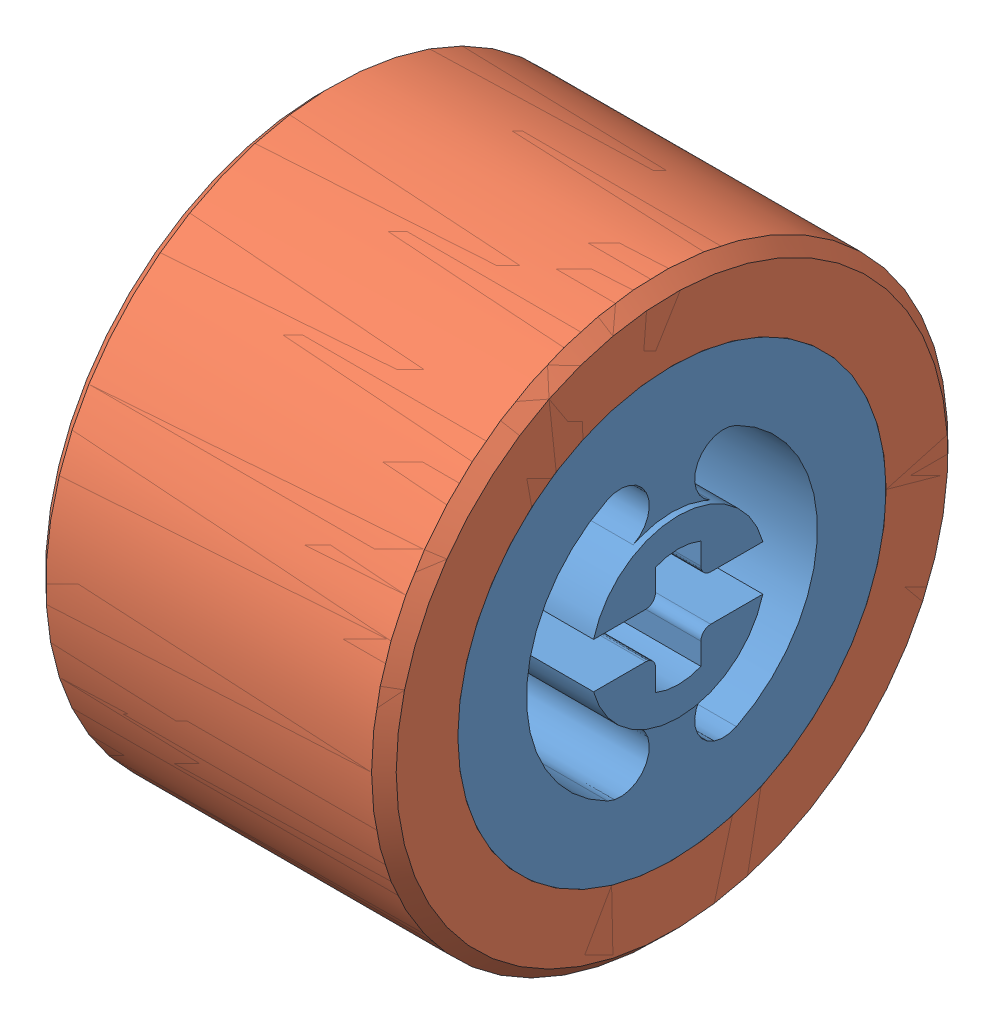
SolidWorks assembly Assem1brede wielen.SLDASM, configuration Default (file format 4400). Lengths in mm.
Overall size (14.73 23.39 23.39).
3 component instances, 2 part files, 4 mates.
Components (placement in the parent):
- wheelDubbel reed-1: wheelDubbel reed.sldprt [Default] at (-3.6359 2.3422 0.3273) size (14.73 17.39 17.39)
- tireSlik-3: tireSlik.sldprt [Default] at (65.1518 2.3422 0.3273) size (14.22 23.39 23.39)
- tireSlik-4: tireSlik.sldprt [Default] at (65.1518 2.3422 0.3273) size (14.22 23.39 23.39)
Mates (geometry in assembly coordinates):
- Concentric2: concentric anti-aligned: cylinder of wheelDubbel reed-1 through (-3.6359 2.3422 0.3273) axis (-1 0 0) radius 8.1153; cylinder of tireSlik-3 through (65.1518 2.3422 0.3273) axis (1 0 0) radius 8.1153
- Coincident2: coincident anti-aligned: plane of wheelDubbel reed-1 through (1.4441 10.4575 0.3273) normal (-1 0 0); plane of tireSlik-3 through (1.4441 10.4575 0.3273) normal (1 0 0)
- Concentric3: concentric anti-aligned: cylinder of wheelDubbel reed-1 through (-3.6359 2.3422 0.3273) axis (-1 0 0) radius 8.1153; cylinder of tireSlik-4 through (65.1518 2.3422 0.3273) axis (1 0 0) radius 8.1153
- Coincident3: coincident anti-aligned: plane of wheelDubbel reed-1 through (1.4441 10.4575 0.3273) normal (-1 0 0); plane of tireSlik-4 through (1.4441 10.4575 0.3273) normal (1 0 0)
